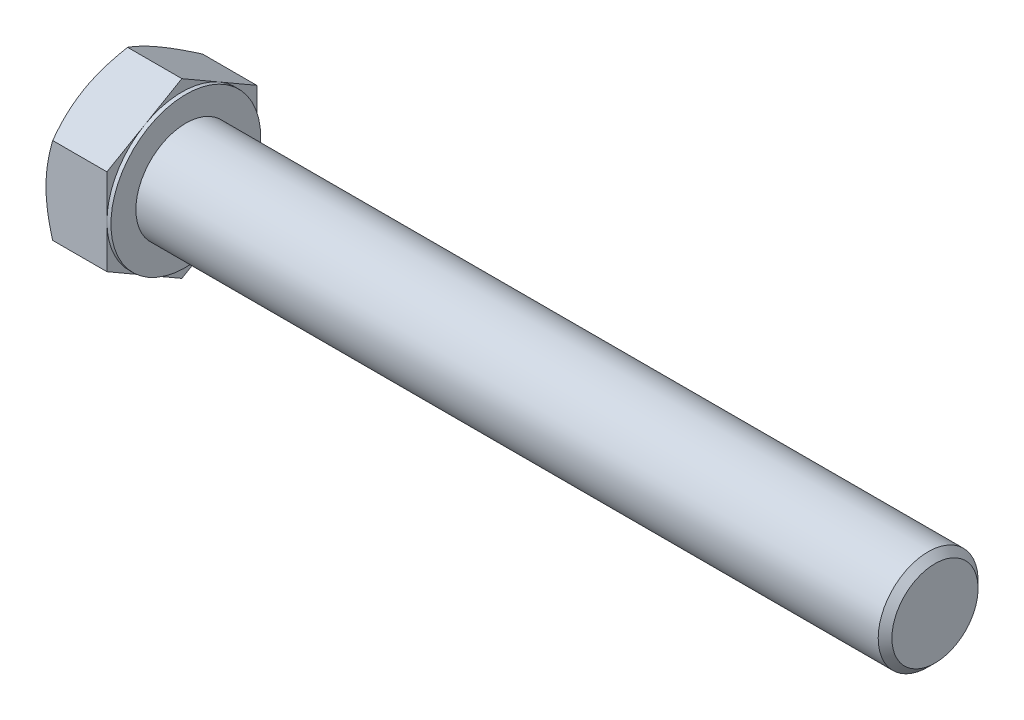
from build123d import *

# Parameters (mm, degrees)
BASEHEAD_DEPTH = 13
BEARINGSKE_W   = 0.8
BEARINGSKE_H   = 2.320508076


with BuildPart() as part:
    # HeadSke → BaseHead (new body)
    with BuildSketch(Plane(origin=(0, 0, 0), x_dir=(0, 0, -1), z_dir=(1, 0, 0))):
        Polygon((15, 8.660254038), (15, -8.660254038), (0, -17.320508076), (-15, -8.660254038), (-15, 8.660254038), (0, 17.320508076), align=None)
    extrude(amount=BASEHEAD_DEPTH)

    # BodySke → BaseBody (revolve)
    with BuildSketch(Plane.XY, mode=Mode.PRIVATE) as basebody_sk:
        Polygon((0, 0), (163, 0), (163, 8.626), (161.626, 10), (0, 10), align=None)
    revolve(basebody_sk.sketch.rotate(Axis((0, 0, 0), (1, 0, 0)), 90), axis=Axis((0, 0, 0), (1, 0, 0)))

    # Sketch3 → HeadChamfer (revolve, cut)
    with BuildSketch(Plane(origin=(0, 0, 0), x_dir=(1, 0, 0), z_dir=(0, 1, 0))):
        Polygon((3.75, 21.495190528), (-3.75, 8.504809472), (-15.804766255, 15.464632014), (-8.304766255, 28.455013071), align=None)
    revolve(axis=Axis((0, 0, 0), (1, 0, 0)), mode=Mode.SUBTRACT)

    # BearingSke → BearingFace (revolve, cut)
    with BuildSketch(Plane.XY, mode=Mode.PRIVATE) as bearingface_sk:
        with Locations((12.6, 16.160254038)):
            Rectangle(BEARINGSKE_W, BEARINGSKE_H)
    revolve(bearingface_sk.sketch.rotate(Axis((0, 0, 0), (1, 0, 0)), 270), axis=Axis((0, 0, 0), (1, 0, 0)), mode=Mode.SUBTRACT)


solid = part.part
